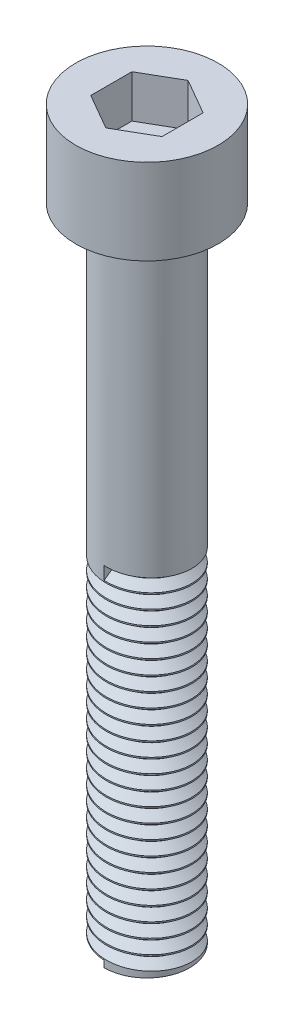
from build123d import *

# Parameters (mm, degrees)
SK_CABEZA_R         = 5
CABEZA_DEPTH        = 6
CANA_START          = -45
SK_CANA_R           = 3
CANA_DEPTH          = 45
HUECO_ALLEN_DEPTH   = 3
ROSCA_M6X1_0_PITCH  = 1
ROSCA_M6X1_0_HEIGHT = 24
ROSCA_M6X1_0_RADIUS = 3


with BuildPart() as part:
    # Sk_Cabeza → Cabeza (new body)
    with BuildSketch(Plane(origin=(0, 0, 0), x_dir=(1, 0, 0), z_dir=(0, 1, 0))):
        with Locations(Location((0, 0, 0), (0, 0, 270))):
            Circle(SK_CABEZA_R)
    extrude(amount=CABEZA_DEPTH)

    # Sk_Cana → Cana (add)
    with BuildSketch(Plane(origin=(0, 0, 0), x_dir=(1, 0, 0), z_dir=(0, 1, 0)).offset(CANA_START)):
        with Locations(Location((0, 0, 0), (0, 0, 90))):
            Circle(SK_CANA_R)
    extrude(amount=CANA_DEPTH)

    # Sk_Hueco_Allen → Hueco_Allen (cut)
    with BuildSketch(Plane(origin=(0, 6, 0), x_dir=(1, 0, 0), z_dir=(0, 1, 0))):
        Polygon((2.5, -1.443375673), (0, -2.886751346), (-2.5, -1.443375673), (-2.5, 1.443375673), (0, 2.886751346), (2.5, 1.443375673), align=None)
    extrude(amount=-HUECO_ALLEN_DEPTH, mode=Mode.SUBTRACT)

    # Rosca_M6x1_0: sweep along a helix
    with BuildLine() as rosca_m6x1_0_path:
        Helix(ROSCA_M6X1_0_PITCH, ROSCA_M6X1_0_HEIGHT, ROSCA_M6X1_0_RADIUS, center=(0, -45, 0), direction=(0, 1, 0), lefthand=True)
    # Sk_Perfil_rosca → Rosca_M6x1_0 (sweep, cut)
    with BuildSketch(Plane(origin=(0, 0, 0), x_dir=(0, 0, -1), z_dir=(1, 0, 0))):
        Polygon((-3.2, -45.6), (-2.3866, -45), (-3.2, -44.4), align=None)
    sweep(path=rosca_m6x1_0_path.line, is_frenet=True, mode=Mode.SUBTRACT)


solid = part.part
